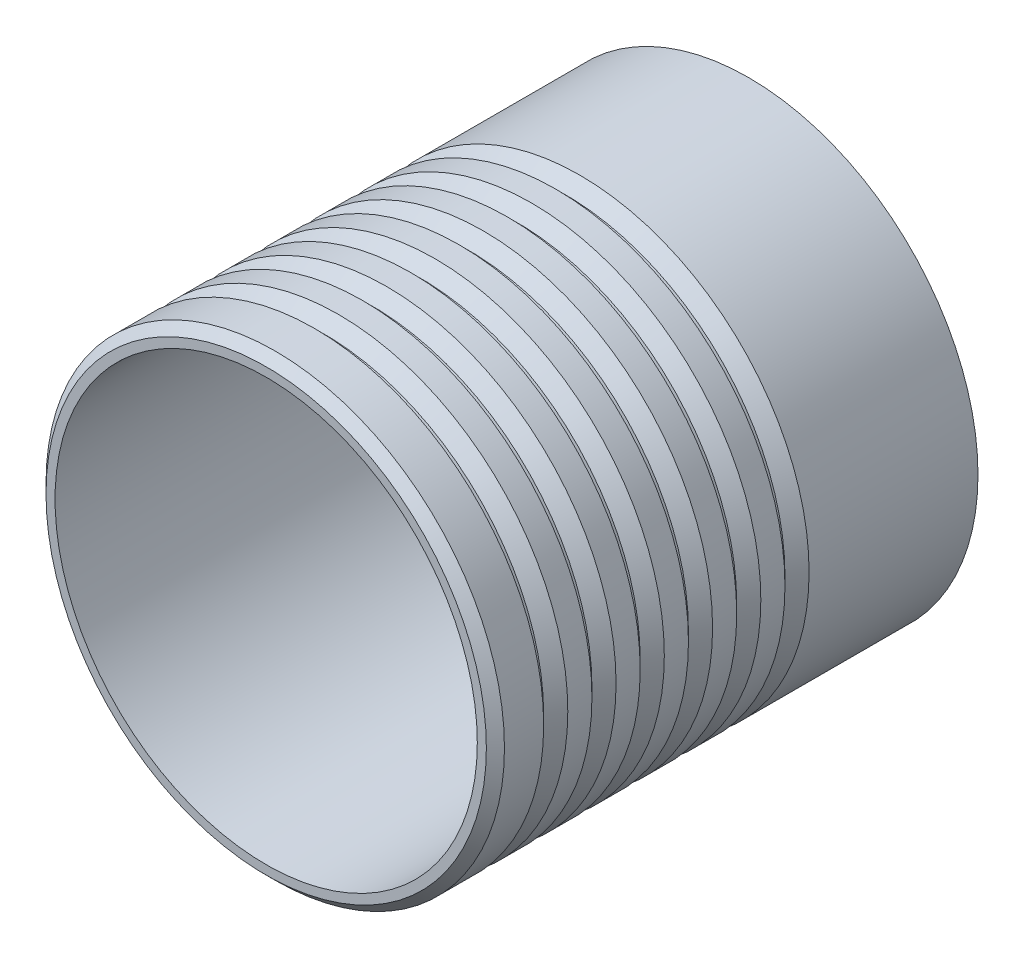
from build123d import *

# Parameters (mm, degrees)
ESQUISSE1_R                = 38
ESQUISSE1_R_2              = 35
EXTRUSION1_DEPTH           = 80
R_P_TITION_LIN_AIRE1_COUNT = 6
R_P_TITION_LIN_AIRE1_PITCH = 8
CHANFREIN1_SIZE            = 1.5


with BuildPart() as part:
    # Esquisse1 → Extrusion1 (new body)
    with BuildSketch(Plane.XY):
        Circle(ESQUISSE1_R)
        Circle(ESQUISSE1_R_2, mode=Mode.SUBTRACT)
    extrude(amount=EXTRUSION1_DEPTH)

    # Esquisse2 → Enl_vement de mati_re-R_volution1 (revolve, cut)
    with BuildSketch(Plane(origin=(0, 0, 0), x_dir=(0, 0, -1), z_dir=(1, 0, 0)), mode=Mode.PRIVATE) as enl_vement_de_mati_re_r_volution1_sk:
        Polygon((-72, 38), (-68, 38), (-70.5, 36.5), (-72, 36.5), align=None)
    enl_vement_de_mati_re_r_volution1 = revolve(enl_vement_de_mati_re_r_volution1_sk.sketch.rotate(Axis((0, 0, 80), (0, 0, -1)), 90), axis=Axis((0, 0, 80), (0, 0, -1)), mode=Mode.SUBTRACT)

    # R_p_tition lin_aire1: Enl_vement de mati_re-R_volution1 ×6
    with Locations(*[(0, 0, -i * R_P_TITION_LIN_AIRE1_PITCH) for i in range(1, R_P_TITION_LIN_AIRE1_COUNT)]):
        add(enl_vement_de_mati_re_r_volution1, mode=Mode.SUBTRACT)

    # Chanfrein1
    chanfrein1_edges = [part.edges().sort_by_distance(p)[0] for p in [
        (-38, 0, 80),
    ]]
    chamfer(chanfrein1_edges, length=CHANFREIN1_SIZE)


solid = part.part
